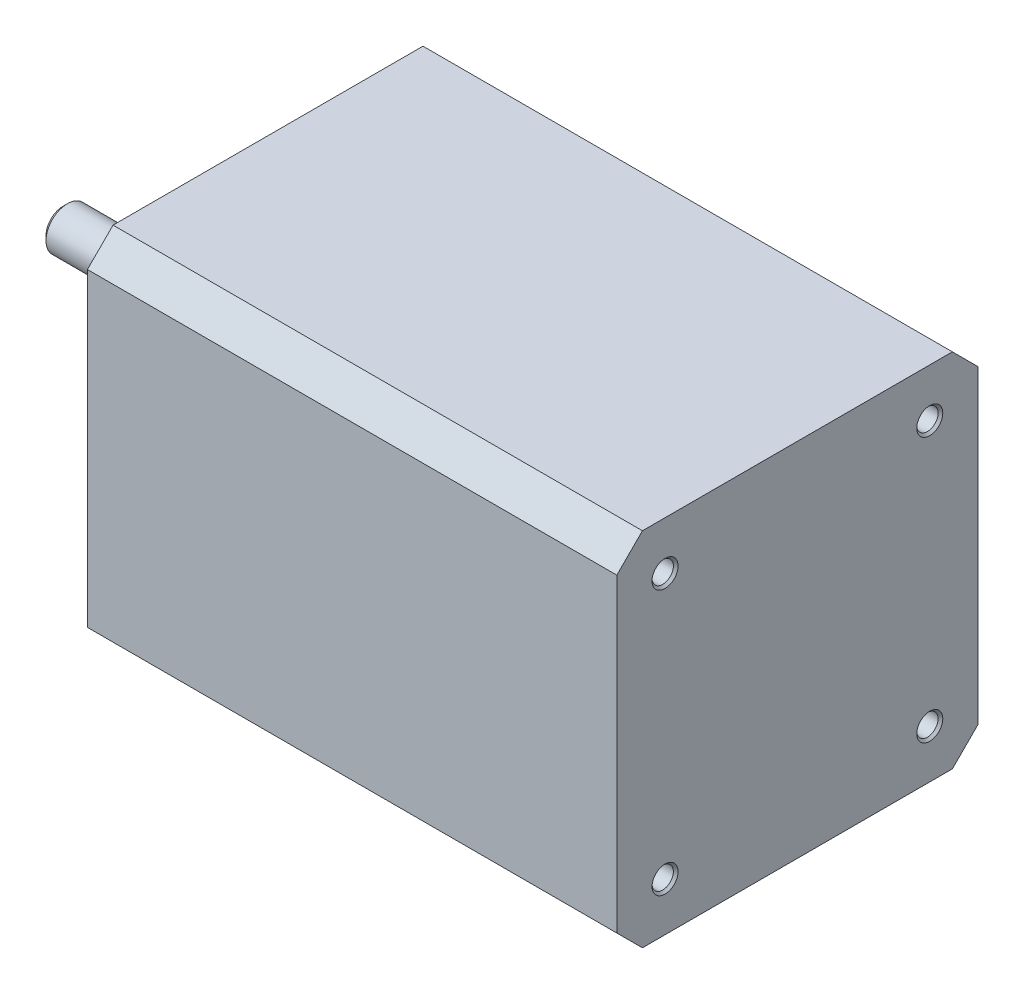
ISO-10303-21;
HEADER;
FILE_DESCRIPTION(('STEP AP214'),'2;1');
FILE_NAME('part.step','',(''),(''),'','','');
FILE_SCHEMA(('AUTOMOTIVE_DESIGN { 1 0 10303 214 1 1 1 1 }'));
ENDSEC;
DATA;
#1=APPLICATION_CONTEXT('core data for automotive mechanical design processes');
#2=APPLICATION_PROTOCOL_DEFINITION('international standard','automotive_design',2000,#1);
#3=PRODUCT_CONTEXT('',#1,'mechanical');
#4=PRODUCT('Part','Part','',(#3));
#5=PRODUCT_RELATED_PRODUCT_CATEGORY('part','',(#4));
#6=PRODUCT_DEFINITION_FORMATION('','',#4);
#7=PRODUCT_DEFINITION_CONTEXT('part definition',#1,'design');
#8=PRODUCT_DEFINITION('design','',#6,#7);
#9=PRODUCT_DEFINITION_SHAPE('','',#8);
#10=(LENGTH_UNIT() NAMED_UNIT(*) SI_UNIT(.MILLI.,.METRE.));
#11=(NAMED_UNIT(*) PLANE_ANGLE_UNIT() SI_UNIT($,.RADIAN.));
#12=(NAMED_UNIT(*) SI_UNIT($,.STERADIAN.) SOLID_ANGLE_UNIT());
#13=UNCERTAINTY_MEASURE_WITH_UNIT(LENGTH_MEASURE(1.E-05),#10,'distance_accuracy_value','');
#14=(GEOMETRIC_REPRESENTATION_CONTEXT(3) GLOBAL_UNCERTAINTY_ASSIGNED_CONTEXT((#13)) GLOBAL_UNIT_ASSIGNED_CONTEXT((#10,
#11,#12)) REPRESENTATION_CONTEXT('',''));
#15=CARTESIAN_POINT('',(0.,0.,0.));
#16=DIRECTION('',(0.,0.,1.));
#17=DIRECTION('',(1.,0.,0.));
#18=AXIS2_PLACEMENT_3D('',#15,#16,#17);
#19=CARTESIAN_POINT('',(62.,21.15,18.15));
#20=DIRECTION('',(0.,-1.,0.));
#21=DIRECTION('',(0.,0.,-1.));
#22=AXIS2_PLACEMENT_3D('',#19,#20,#21);
#23=PLANE('',#22);
#24=DIRECTION('',(0.,0.,1.));
#25=VECTOR('',#24,1.);
#26=CARTESIAN_POINT('',(0.,21.15,18.15));
#27=LINE('',#26,#25);
#28=CARTESIAN_POINT('',(0.,21.15,-18.15));
#29=VERTEX_POINT('',#28);
#30=CARTESIAN_POINT('',(0.,21.15,18.15));
#31=VERTEX_POINT('',#30);
#32=EDGE_CURVE('E150',#29,#31,#27,.T.);
#33=ORIENTED_EDGE('',*,*,#32,.T.);
#34=DIRECTION('',(-1.,0.,0.));
#35=VECTOR('',#34,1.);
#36=CARTESIAN_POINT('',(62.,21.15,18.15));
#37=LINE('',#36,#35);
#38=CARTESIAN_POINT('',(62.,21.15,18.15));
#39=VERTEX_POINT('',#38);
#40=EDGE_CURVE('E178',#39,#31,#37,.T.);
#41=ORIENTED_EDGE('',*,*,#40,.F.);
#42=DIRECTION('',(0.,0.,1.));
#43=VECTOR('',#42,1.);
#44=CARTESIAN_POINT('',(62.,21.15,18.15));
#45=LINE('',#44,#43);
#46=CARTESIAN_POINT('',(62.,21.15,-18.15));
#47=VERTEX_POINT('',#46);
#48=EDGE_CURVE('E165',#47,#39,#45,.T.);
#49=ORIENTED_EDGE('',*,*,#48,.F.);
#50=DIRECTION('',(-1.,0.,0.));
#51=VECTOR('',#50,1.);
#52=CARTESIAN_POINT('',(62.,21.15,-18.15));
#53=LINE('',#52,#51);
#54=EDGE_CURVE('E146',#47,#29,#53,.T.);
#55=ORIENTED_EDGE('',*,*,#54,.T.);
#56=EDGE_LOOP('',(#33,#41,#49,#55));
#57=FACE_BOUND('',#56,.T.);
#58=ADVANCED_FACE('F49',(#57),#23,.F.);
#59=CARTESIAN_POINT('',(62.,18.15,21.15));
#60=DIRECTION('',(0.,-0.707106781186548,-0.707106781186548));
#61=DIRECTION('',(0.,0.707106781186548,-0.707106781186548));
#62=AXIS2_PLACEMENT_3D('',#59,#60,#61);
#63=PLANE('',#62);
#64=DIRECTION('',(0.,-0.707106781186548,0.707106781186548));
#65=VECTOR('',#64,1.);
#66=CARTESIAN_POINT('',(0.,18.15,21.15));
#67=LINE('',#66,#65);
#68=CARTESIAN_POINT('',(0.,18.15,21.15));
#69=VERTEX_POINT('',#68);
#70=EDGE_CURVE('E153',#31,#69,#67,.T.);
#71=ORIENTED_EDGE('',*,*,#70,.T.);
#72=DIRECTION('',(-1.,0.,0.));
#73=VECTOR('',#72,1.);
#74=CARTESIAN_POINT('',(62.,18.15,21.15));
#75=LINE('',#74,#73);
#76=CARTESIAN_POINT('',(62.,18.15,21.15));
#77=VERTEX_POINT('',#76);
#78=EDGE_CURVE('E175',#77,#69,#75,.T.);
#79=ORIENTED_EDGE('',*,*,#78,.F.);
#80=DIRECTION('',(0.,-0.707106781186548,0.707106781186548));
#81=VECTOR('',#80,1.);
#82=CARTESIAN_POINT('',(62.,18.15,21.15));
#83=LINE('',#82,#81);
#84=EDGE_CURVE('E113',#39,#77,#83,.T.);
#85=ORIENTED_EDGE('',*,*,#84,.F.);
#86=ORIENTED_EDGE('',*,*,#40,.T.);
#87=EDGE_LOOP('',(#71,#79,#85,#86));
#88=FACE_BOUND('',#87,.T.);
#89=ADVANCED_FACE('F256',(#88),#63,.F.);
#90=CARTESIAN_POINT('',(62.,18.15,21.15));
#91=DIRECTION('',(0.,0.,-1.));
#92=DIRECTION('',(0.,1.,0.));
#93=AXIS2_PLACEMENT_3D('',#90,#91,#92);
#94=PLANE('',#93);
#95=DIRECTION('',(0.,-1.,0.));
#96=VECTOR('',#95,1.);
#97=CARTESIAN_POINT('',(0.,18.15,21.15));
#98=LINE('',#97,#96);
#99=CARTESIAN_POINT('',(0.,-18.15,21.15));
#100=VERTEX_POINT('',#99);
#101=EDGE_CURVE('E156',#69,#100,#98,.T.);
#102=ORIENTED_EDGE('',*,*,#101,.T.);
#103=DIRECTION('',(-1.,0.,0.));
#104=VECTOR('',#103,1.);
#105=CARTESIAN_POINT('',(62.,-18.15,21.15));
#106=LINE('',#105,#104);
#107=CARTESIAN_POINT('',(62.,-18.15,21.15));
#108=VERTEX_POINT('',#107);
#109=EDGE_CURVE('E172',#108,#100,#106,.T.);
#110=ORIENTED_EDGE('',*,*,#109,.F.);
#111=DIRECTION('',(0.,-1.,0.));
#112=VECTOR('',#111,1.);
#113=CARTESIAN_POINT('',(62.,18.15,21.15));
#114=LINE('',#113,#112);
#115=EDGE_CURVE('E223',#77,#108,#114,.T.);
#116=ORIENTED_EDGE('',*,*,#115,.F.);
#117=ORIENTED_EDGE('',*,*,#78,.T.);
#118=EDGE_LOOP('',(#102,#110,#116,#117));
#119=FACE_BOUND('',#118,.T.);
#120=ADVANCED_FACE('F260',(#119),#94,.F.);
#121=CARTESIAN_POINT('',(62.,-18.15,21.15));
#122=DIRECTION('',(0.,0.707106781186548,-0.707106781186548));
#123=DIRECTION('',(0.,0.707106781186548,0.707106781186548));
#124=AXIS2_PLACEMENT_3D('',#121,#122,#123);
#125=PLANE('',#124);
#126=DIRECTION('',(0.,-0.707106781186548,-0.707106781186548));
#127=VECTOR('',#126,1.);
#128=CARTESIAN_POINT('',(0.,-18.15,21.15));
#129=LINE('',#128,#127);
#130=CARTESIAN_POINT('',(0.,-21.15,18.15));
#131=VERTEX_POINT('',#130);
#132=EDGE_CURVE('E158',#100,#131,#129,.T.);
#133=ORIENTED_EDGE('',*,*,#132,.T.);
#134=DIRECTION('',(-1.,0.,0.));
#135=VECTOR('',#134,1.);
#136=CARTESIAN_POINT('',(62.,-21.15,18.15));
#137=LINE('',#136,#135);
#138=CARTESIAN_POINT('',(62.,-21.15,18.15));
#139=VERTEX_POINT('',#138);
#140=EDGE_CURVE('E169',#139,#131,#137,.T.);
#141=ORIENTED_EDGE('',*,*,#140,.F.);
#142=DIRECTION('',(0.,-0.707106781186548,-0.707106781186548));
#143=VECTOR('',#142,1.);
#144=CARTESIAN_POINT('',(62.,-18.15,21.15));
#145=LINE('',#144,#143);
#146=EDGE_CURVE('E225',#108,#139,#145,.T.);
#147=ORIENTED_EDGE('',*,*,#146,.F.);
#148=ORIENTED_EDGE('',*,*,#109,.T.);
#149=EDGE_LOOP('',(#133,#141,#147,#148));
#150=FACE_BOUND('',#149,.T.);
#151=ADVANCED_FACE('F231',(#150),#125,.F.);
#152=CARTESIAN_POINT('',(62.,-21.15,18.15));
#153=DIRECTION('',(0.,1.,0.));
#154=DIRECTION('',(0.,0.,1.));
#155=AXIS2_PLACEMENT_3D('',#152,#153,#154);
#156=PLANE('',#155);
#157=DIRECTION('',(0.,0.,-1.));
#158=VECTOR('',#157,1.);
#159=CARTESIAN_POINT('',(0.,-21.15,18.15));
#160=LINE('',#159,#158);
#161=CARTESIAN_POINT('',(0.,-21.15,-18.15));
#162=VERTEX_POINT('',#161);
#163=EDGE_CURVE('E160',#131,#162,#160,.T.);
#164=ORIENTED_EDGE('',*,*,#163,.T.);
#165=DIRECTION('',(-1.,0.,0.));
#166=VECTOR('',#165,1.);
#167=CARTESIAN_POINT('',(62.,-21.15,-18.15));
#168=LINE('',#167,#166);
#169=CARTESIAN_POINT('',(62.,-21.15,-18.15));
#170=VERTEX_POINT('',#169);
#171=EDGE_CURVE('E141',#170,#162,#168,.T.);
#172=ORIENTED_EDGE('',*,*,#171,.F.);
#173=DIRECTION('',(0.,0.,-1.));
#174=VECTOR('',#173,1.);
#175=CARTESIAN_POINT('',(62.,-21.15,18.15));
#176=LINE('',#175,#174);
#177=EDGE_CURVE('E132',#139,#170,#176,.T.);
#178=ORIENTED_EDGE('',*,*,#177,.F.);
#179=ORIENTED_EDGE('',*,*,#140,.T.);
#180=EDGE_LOOP('',(#164,#172,#178,#179));
#181=FACE_BOUND('',#180,.T.);
#182=ADVANCED_FACE('F235',(#181),#156,.F.);
#183=CARTESIAN_POINT('',(62.,-21.15,-18.15));
#184=DIRECTION('',(0.,0.707106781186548,0.707106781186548));
#185=DIRECTION('',(0.,-0.707106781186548,0.707106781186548));
#186=AXIS2_PLACEMENT_3D('',#183,#184,#185);
#187=PLANE('',#186);
#188=DIRECTION('',(0.,0.707106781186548,-0.707106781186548));
#189=VECTOR('',#188,1.);
#190=CARTESIAN_POINT('',(0.,-21.15,-18.15));
#191=LINE('',#190,#189);
#192=CARTESIAN_POINT('',(0.,-18.15,-21.15));
#193=VERTEX_POINT('',#192);
#194=EDGE_CURVE('E140',#162,#193,#191,.T.);
#195=ORIENTED_EDGE('',*,*,#194,.T.);
#196=DIRECTION('',(-1.,0.,0.));
#197=VECTOR('',#196,1.);
#198=CARTESIAN_POINT('',(62.,-18.15,-21.15));
#199=LINE('',#198,#197);
#200=CARTESIAN_POINT('',(62.,-18.15,-21.15));
#201=VERTEX_POINT('',#200);
#202=EDGE_CURVE('E137',#201,#193,#199,.T.);
#203=ORIENTED_EDGE('',*,*,#202,.F.);
#204=DIRECTION('',(0.,0.707106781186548,-0.707106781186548));
#205=VECTOR('',#204,1.);
#206=CARTESIAN_POINT('',(62.,-21.15,-18.15));
#207=LINE('',#206,#205);
#208=EDGE_CURVE('E126',#170,#201,#207,.T.);
#209=ORIENTED_EDGE('',*,*,#208,.F.);
#210=ORIENTED_EDGE('',*,*,#171,.T.);
#211=EDGE_LOOP('',(#195,#203,#209,#210));
#212=FACE_BOUND('',#211,.T.);
#213=ADVANCED_FACE('F138',(#212),#187,.F.);
#214=CARTESIAN_POINT('',(62.,18.15,-21.15));
#215=DIRECTION('',(0.,0.,1.));
#216=DIRECTION('',(0.,-1.,0.));
#217=AXIS2_PLACEMENT_3D('',#214,#215,#216);
#218=PLANE('',#217);
#219=DIRECTION('',(0.,1.,0.));
#220=VECTOR('',#219,1.);
#221=CARTESIAN_POINT('',(0.,18.15,-21.15));
#222=LINE('',#221,#220);
#223=CARTESIAN_POINT('',(0.,18.15,-21.15));
#224=VERTEX_POINT('',#223);
#225=EDGE_CURVE('E98',#193,#224,#222,.T.);
#226=ORIENTED_EDGE('',*,*,#225,.T.);
#227=DIRECTION('',(-1.,0.,0.));
#228=VECTOR('',#227,1.);
#229=CARTESIAN_POINT('',(62.,18.15,-21.15));
#230=LINE('',#229,#228);
#231=CARTESIAN_POINT('',(62.,18.15,-21.15));
#232=VERTEX_POINT('',#231);
#233=EDGE_CURVE('E142',#232,#224,#230,.T.);
#234=ORIENTED_EDGE('',*,*,#233,.F.);
#235=DIRECTION('',(0.,1.,0.));
#236=VECTOR('',#235,1.);
#237=CARTESIAN_POINT('',(62.,18.15,-21.15));
#238=LINE('',#237,#236);
#239=EDGE_CURVE('E130',#201,#232,#238,.T.);
#240=ORIENTED_EDGE('',*,*,#239,.F.);
#241=ORIENTED_EDGE('',*,*,#202,.T.);
#242=EDGE_LOOP('',(#226,#234,#240,#241));
#243=FACE_BOUND('',#242,.T.);
#244=ADVANCED_FACE('F144',(#243),#218,.F.);
#245=CARTESIAN_POINT('',(62.,21.15,-18.15));
#246=DIRECTION('',(0.,-0.707106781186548,0.707106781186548));
#247=DIRECTION('',(0.,-0.707106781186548,-0.707106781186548));
#248=AXIS2_PLACEMENT_3D('',#245,#246,#247);
#249=PLANE('',#248);
#250=DIRECTION('',(0.,0.707106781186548,0.707106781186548));
#251=VECTOR('',#250,1.);
#252=CARTESIAN_POINT('',(0.,21.15,-18.15));
#253=LINE('',#252,#251);
#254=EDGE_CURVE('E104',#224,#29,#253,.T.);
#255=ORIENTED_EDGE('',*,*,#254,.T.);
#256=ORIENTED_EDGE('',*,*,#54,.F.);
#257=DIRECTION('',(0.,0.707106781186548,0.707106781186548));
#258=VECTOR('',#257,1.);
#259=CARTESIAN_POINT('',(62.,21.15,-18.15));
#260=LINE('',#259,#258);
#261=EDGE_CURVE('E69',#232,#47,#260,.T.);
#262=ORIENTED_EDGE('',*,*,#261,.F.);
#263=ORIENTED_EDGE('',*,*,#233,.T.);
#264=EDGE_LOOP('',(#255,#256,#262,#263));
#265=FACE_BOUND('',#264,.T.);
#266=ADVANCED_FACE('F243',(#265),#249,.F.);
#267=CARTESIAN_POINT('',(62.,0.,0.));
#268=DIRECTION('',(-1.,0.,0.));
#269=DIRECTION('',(0.,0.,1.));
#270=AXIS2_PLACEMENT_3D('',#267,#268,#269);
#271=PLANE('',#270);
#272=CARTESIAN_POINT('',(62.,15.5,15.5));
#273=DIRECTION('',(1.,0.,0.));
#274=DIRECTION('',(0.,0.,-1.));
#275=AXIS2_PLACEMENT_3D('',#272,#273,#274);
#276=CIRCLE('',#275,1.525);
#277=CARTESIAN_POINT('',(62.,15.5,13.975));
#278=VERTEX_POINT('',#277);
#279=EDGE_CURVE('E442',#278,#278,#276,.T.);
#280=ORIENTED_EDGE('',*,*,#279,.F.);
#281=EDGE_LOOP('',(#280));
#282=FACE_BOUND('',#281,.T.);
#283=CARTESIAN_POINT('',(62.,-15.5,15.5));
#284=DIRECTION('',(1.,0.,0.));
#285=DIRECTION('',(0.,0.,-1.));
#286=AXIS2_PLACEMENT_3D('',#283,#284,#285);
#287=CIRCLE('',#286,1.525);
#288=CARTESIAN_POINT('',(62.,-15.5,13.975));
#289=VERTEX_POINT('',#288);
#290=EDGE_CURVE('E201',#289,#289,#287,.T.);
#291=ORIENTED_EDGE('',*,*,#290,.F.);
#292=EDGE_LOOP('',(#291));
#293=FACE_BOUND('',#292,.T.);
#294=CARTESIAN_POINT('',(62.,-15.5,-15.5));
#295=DIRECTION('',(1.,0.,0.));
#296=DIRECTION('',(0.,0.,-1.));
#297=AXIS2_PLACEMENT_3D('',#294,#295,#296);
#298=CIRCLE('',#297,1.525);
#299=CARTESIAN_POINT('',(62.,-15.5,-17.025));
#300=VERTEX_POINT('',#299);
#301=EDGE_CURVE('E194',#300,#300,#298,.T.);
#302=ORIENTED_EDGE('',*,*,#301,.F.);
#303=EDGE_LOOP('',(#302));
#304=FACE_BOUND('',#303,.T.);
#305=CARTESIAN_POINT('',(62.,15.5,-15.5));
#306=DIRECTION('',(1.,0.,0.));
#307=DIRECTION('',(0.,0.,-1.));
#308=AXIS2_PLACEMENT_3D('',#305,#306,#307);
#309=CIRCLE('',#308,1.525);
#310=CARTESIAN_POINT('',(62.,15.5,-17.025));
#311=VERTEX_POINT('',#310);
#312=EDGE_CURVE('E190',#311,#311,#309,.T.);
#313=ORIENTED_EDGE('',*,*,#312,.F.);
#314=EDGE_LOOP('',(#313));
#315=FACE_BOUND('',#314,.T.);
#316=ORIENTED_EDGE('',*,*,#48,.T.);
#317=ORIENTED_EDGE('',*,*,#84,.T.);
#318=ORIENTED_EDGE('',*,*,#115,.T.);
#319=ORIENTED_EDGE('',*,*,#146,.T.);
#320=ORIENTED_EDGE('',*,*,#177,.T.);
#321=ORIENTED_EDGE('',*,*,#208,.T.);
#322=ORIENTED_EDGE('',*,*,#239,.T.);
#323=ORIENTED_EDGE('',*,*,#261,.T.);
#324=EDGE_LOOP('',(#316,#317,#318,#319,#320,#321,#322,#323));
#325=FACE_BOUND('',#324,.T.);
#326=ADVANCED_FACE('F128',(#282,#293,#304,#315,#325),#271,.F.);
#327=CARTESIAN_POINT('',(0.,0.,0.));
#328=DIRECTION('',(-1.,0.,0.));
#329=DIRECTION('',(0.,0.,1.));
#330=AXIS2_PLACEMENT_3D('',#327,#328,#329);
#331=PLANE('',#330);
#332=CARTESIAN_POINT('',(0.,15.5,15.5));
#333=DIRECTION('',(-1.,0.,0.));
#334=DIRECTION('',(0.,0.,1.));
#335=AXIS2_PLACEMENT_3D('',#332,#333,#334);
#336=CIRCLE('',#335,1.24999999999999);
#337=CARTESIAN_POINT('',(0.,15.5,16.75));
#338=VERTEX_POINT('',#337);
#339=EDGE_CURVE('E54',#338,#338,#336,.T.);
#340=ORIENTED_EDGE('',*,*,#339,.F.);
#341=EDGE_LOOP('',(#340));
#342=FACE_BOUND('',#341,.T.);
#343=CARTESIAN_POINT('',(0.,-15.5,15.5));
#344=DIRECTION('',(-1.,0.,0.));
#345=DIRECTION('',(0.,0.,1.));
#346=AXIS2_PLACEMENT_3D('',#343,#344,#345);
#347=CIRCLE('',#346,1.24999999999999);
#348=CARTESIAN_POINT('',(0.,-15.5,16.75));
#349=VERTEX_POINT('',#348);
#350=EDGE_CURVE('E192',#349,#349,#347,.T.);
#351=ORIENTED_EDGE('',*,*,#350,.F.);
#352=EDGE_LOOP('',(#351));
#353=FACE_BOUND('',#352,.T.);
#354=CARTESIAN_POINT('',(0.,-15.5,-15.5));
#355=DIRECTION('',(-1.,0.,0.));
#356=DIRECTION('',(0.,0.,1.));
#357=AXIS2_PLACEMENT_3D('',#354,#355,#356);
#358=CIRCLE('',#357,1.24999999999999);
#359=CARTESIAN_POINT('',(0.,-15.5,-14.25));
#360=VERTEX_POINT('',#359);
#361=EDGE_CURVE('E188',#360,#360,#358,.T.);
#362=ORIENTED_EDGE('',*,*,#361,.F.);
#363=EDGE_LOOP('',(#362));
#364=FACE_BOUND('',#363,.T.);
#365=CARTESIAN_POINT('',(0.,15.5,-15.5));
#366=DIRECTION('',(-1.,0.,0.));
#367=DIRECTION('',(0.,0.,1.));
#368=AXIS2_PLACEMENT_3D('',#365,#366,#367);
#369=CIRCLE('',#368,1.24999999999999);
#370=CARTESIAN_POINT('',(0.,15.5,-14.25));
#371=VERTEX_POINT('',#370);
#372=EDGE_CURVE('E184',#371,#371,#369,.T.);
#373=ORIENTED_EDGE('',*,*,#372,.F.);
#374=EDGE_LOOP('',(#373));
#375=FACE_BOUND('',#374,.T.);
#376=CARTESIAN_POINT('',(0.,0.,0.));
#377=DIRECTION('',(-1.,0.,0.));
#378=DIRECTION('',(0.,0.,1.));
#379=AXIS2_PLACEMENT_3D('',#376,#377,#378);
#380=CIRCLE('',#379,11.);
#381=CARTESIAN_POINT('',(0.,0.,11.));
#382=VERTEX_POINT('',#381);
#383=EDGE_CURVE('E180',#382,#382,#380,.T.);
#384=ORIENTED_EDGE('',*,*,#383,.F.);
#385=EDGE_LOOP('',(#384));
#386=FACE_BOUND('',#385,.T.);
#387=ORIENTED_EDGE('',*,*,#32,.F.);
#388=ORIENTED_EDGE('',*,*,#254,.F.);
#389=ORIENTED_EDGE('',*,*,#225,.F.);
#390=ORIENTED_EDGE('',*,*,#194,.F.);
#391=ORIENTED_EDGE('',*,*,#163,.F.);
#392=ORIENTED_EDGE('',*,*,#132,.F.);
#393=ORIENTED_EDGE('',*,*,#101,.F.);
#394=ORIENTED_EDGE('',*,*,#70,.F.);
#395=EDGE_LOOP('',(#387,#388,#389,#390,#391,#392,#393,#394));
#396=FACE_BOUND('',#395,.T.);
#397=ADVANCED_FACE('F238',(#342,#353,#364,#375,#386,#396),#331,.T.);
#398=CARTESIAN_POINT('',(-2.,0.,0.));
#399=DIRECTION('',(1.,0.,0.));
#400=DIRECTION('',(0.,0.,-1.));
#401=AXIS2_PLACEMENT_3D('',#398,#399,#400);
#402=CYLINDRICAL_SURFACE('',#401,11.);
#403=CARTESIAN_POINT('',(-2.,0.,0.));
#404=DIRECTION('',(-1.,0.,0.));
#405=DIRECTION('',(0.,0.,1.));
#406=AXIS2_PLACEMENT_3D('',#403,#404,#405);
#407=CIRCLE('',#406,11.);
#408=CARTESIAN_POINT('',(-2.,0.,11.));
#409=VERTEX_POINT('',#408);
#410=EDGE_CURVE('E154',#409,#409,#407,.T.);
#411=ORIENTED_EDGE('',*,*,#410,.F.);
#412=EDGE_LOOP('',(#411));
#413=FACE_BOUND('',#412,.T.);
#414=ORIENTED_EDGE('',*,*,#383,.T.);
#415=EDGE_LOOP('',(#414));
#416=FACE_BOUND('',#415,.T.);
#417=ADVANCED_FACE('F301',(#413,#416),#402,.T.);
#418=CARTESIAN_POINT('',(-2.,0.,0.));
#419=DIRECTION('',(-1.,0.,0.));
#420=DIRECTION('',(0.,0.,1.));
#421=AXIS2_PLACEMENT_3D('',#418,#419,#420);
#422=PLANE('',#421);
#423=CARTESIAN_POINT('',(-2.,0.,0.));
#424=DIRECTION('',(-1.,0.,0.));
#425=DIRECTION('',(0.,0.,1.));
#426=AXIS2_PLACEMENT_3D('',#423,#424,#425);
#427=CIRCLE('',#426,2.5);
#428=CARTESIAN_POINT('',(-2.,0.,2.5));
#429=VERTEX_POINT('',#428);
#430=EDGE_CURVE('E182',#429,#429,#427,.T.);
#431=ORIENTED_EDGE('',*,*,#430,.F.);
#432=EDGE_LOOP('',(#431));
#433=FACE_BOUND('',#432,.T.);
#434=ORIENTED_EDGE('',*,*,#410,.T.);
#435=EDGE_LOOP('',(#434));
#436=FACE_BOUND('',#435,.T.);
#437=ADVANCED_FACE('F310',(#433,#436),#422,.T.);
#438=CARTESIAN_POINT('',(-24.,0.,0.));
#439=DIRECTION('',(1.,0.,0.));
#440=DIRECTION('',(0.,0.,-1.));
#441=AXIS2_PLACEMENT_3D('',#438,#439,#440);
#442=CYLINDRICAL_SURFACE('',#441,2.5);
#443=CARTESIAN_POINT('',(-23.5,0.,0.));
#444=DIRECTION('',(-1.,0.,0.));
#445=DIRECTION('',(0.,0.,1.));
#446=AXIS2_PLACEMENT_3D('',#443,#444,#445);
#447=CIRCLE('',#446,2.5);
#448=CARTESIAN_POINT('',(-23.5,0.,2.5));
#449=VERTEX_POINT('',#448);
#450=EDGE_CURVE('E11',#449,#449,#447,.F.);
#451=ORIENTED_EDGE('',*,*,#450,.T.);
#452=EDGE_LOOP('',(#451));
#453=FACE_BOUND('',#452,.T.);
#454=ORIENTED_EDGE('',*,*,#430,.T.);
#455=EDGE_LOOP('',(#454));
#456=FACE_BOUND('',#455,.T.);
#457=ADVANCED_FACE('F320',(#453,#456),#442,.T.);
#458=CARTESIAN_POINT('',(-24.,0.,0.));
#459=DIRECTION('',(-1.,0.,0.));
#460=DIRECTION('',(0.,0.,1.));
#461=AXIS2_PLACEMENT_3D('',#458,#459,#460);
#462=PLANE('',#461);
#463=CARTESIAN_POINT('',(-24.,0.,0.));
#464=DIRECTION('',(-1.,0.,0.));
#465=DIRECTION('',(0.,0.,1.));
#466=AXIS2_PLACEMENT_3D('',#463,#464,#465);
#467=CIRCLE('',#466,2.00000000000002);
#468=CARTESIAN_POINT('',(-24.,0.,2.00000000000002));
#469=VERTEX_POINT('',#468);
#470=EDGE_CURVE('E60',#469,#469,#467,.T.);
#471=ORIENTED_EDGE('',*,*,#470,.T.);
#472=EDGE_LOOP('',(#471));
#473=FACE_BOUND('',#472,.T.);
#474=ADVANCED_FACE('F330',(#473),#462,.T.);
#475=CARTESIAN_POINT('',(-24.,0.,0.));
#476=DIRECTION('',(1.,0.,0.));
#477=DIRECTION('',(0.,0.,-1.));
#478=AXIS2_PLACEMENT_3D('',#475,#476,#477);
#479=CONICAL_SURFACE('',#478,2.00000000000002,0.785398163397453);
#480=ORIENTED_EDGE('',*,*,#450,.F.);
#481=EDGE_LOOP('',(#480));
#482=FACE_BOUND('',#481,.T.);
#483=ORIENTED_EDGE('',*,*,#470,.F.);
#484=EDGE_LOOP('',(#483));
#485=FACE_BOUND('',#484,.T.);
#486=ADVANCED_FACE('F52',(#482,#485),#479,.T.);
#487=CARTESIAN_POINT('',(62.,15.5,-15.5));
#488=DIRECTION('',(1.,0.,0.));
#489=DIRECTION('',(0.,0.,-1.));
#490=AXIS2_PLACEMENT_3D('',#487,#488,#489);
#491=CYLINDRICAL_SURFACE('',#490,1.24999999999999);
#492=ORIENTED_EDGE('',*,*,#372,.T.);
#493=EDGE_LOOP('',(#492));
#494=FACE_BOUND('',#493,.T.);
#495=CARTESIAN_POINT('',(61.725,15.5,-15.5));
#496=DIRECTION('',(1.,0.,0.));
#497=DIRECTION('',(0.,0.,-1.));
#498=AXIS2_PLACEMENT_3D('',#495,#496,#497);
#499=CIRCLE('',#498,1.25);
#500=CARTESIAN_POINT('',(61.725,15.5,-16.75));
#501=VERTEX_POINT('',#500);
#502=EDGE_CURVE('E187',#501,#501,#499,.T.);
#503=ORIENTED_EDGE('',*,*,#502,.T.);
#504=EDGE_LOOP('',(#503));
#505=FACE_BOUND('',#504,.T.);
#506=ADVANCED_FACE('F348',(#494,#505),#491,.F.);
#507=CARTESIAN_POINT('',(62.,15.5,-15.5));
#508=DIRECTION('',(1.,0.,0.));
#509=DIRECTION('',(0.,0.,-1.));
#510=AXIS2_PLACEMENT_3D('',#507,#508,#509);
#511=CONICAL_SURFACE('',#510,1.525,0.785398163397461);
#512=ORIENTED_EDGE('',*,*,#502,.F.);
#513=EDGE_LOOP('',(#512));
#514=FACE_BOUND('',#513,.T.);
#515=ORIENTED_EDGE('',*,*,#312,.T.);
#516=EDGE_LOOP('',(#515));
#517=FACE_BOUND('',#516,.T.);
#518=ADVANCED_FACE('F357',(#514,#517),#511,.F.);
#519=CARTESIAN_POINT('',(62.,-15.5,-15.5));
#520=DIRECTION('',(1.,0.,0.));
#521=DIRECTION('',(0.,0.,-1.));
#522=AXIS2_PLACEMENT_3D('',#519,#520,#521);
#523=CYLINDRICAL_SURFACE('',#522,1.24999999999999);
#524=ORIENTED_EDGE('',*,*,#361,.T.);
#525=EDGE_LOOP('',(#524));
#526=FACE_BOUND('',#525,.T.);
#527=CARTESIAN_POINT('',(61.725,-15.5,-15.5));
#528=DIRECTION('',(1.,0.,0.));
#529=DIRECTION('',(0.,0.,-1.));
#530=AXIS2_PLACEMENT_3D('',#527,#528,#529);
#531=CIRCLE('',#530,1.25);
#532=CARTESIAN_POINT('',(61.725,-15.5,-16.75));
#533=VERTEX_POINT('',#532);
#534=EDGE_CURVE('E191',#533,#533,#531,.T.);
#535=ORIENTED_EDGE('',*,*,#534,.T.);
#536=EDGE_LOOP('',(#535));
#537=FACE_BOUND('',#536,.T.);
#538=ADVANCED_FACE('F368',(#526,#537),#523,.F.);
#539=CARTESIAN_POINT('',(62.,-15.5,-15.5));
#540=DIRECTION('',(1.,0.,0.));
#541=DIRECTION('',(0.,0.,-1.));
#542=AXIS2_PLACEMENT_3D('',#539,#540,#541);
#543=CONICAL_SURFACE('',#542,1.525,0.785398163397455);
#544=ORIENTED_EDGE('',*,*,#534,.F.);
#545=EDGE_LOOP('',(#544));
#546=FACE_BOUND('',#545,.T.);
#547=ORIENTED_EDGE('',*,*,#301,.T.);
#548=EDGE_LOOP('',(#547));
#549=FACE_BOUND('',#548,.T.);
#550=ADVANCED_FACE('F379',(#546,#549),#543,.F.);
#551=CARTESIAN_POINT('',(62.,-15.5,15.5));
#552=DIRECTION('',(1.,0.,0.));
#553=DIRECTION('',(0.,0.,-1.));
#554=AXIS2_PLACEMENT_3D('',#551,#552,#553);
#555=CYLINDRICAL_SURFACE('',#554,1.24999999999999);
#556=ORIENTED_EDGE('',*,*,#350,.T.);
#557=EDGE_LOOP('',(#556));
#558=FACE_BOUND('',#557,.T.);
#559=CARTESIAN_POINT('',(61.725,-15.5,15.5));
#560=DIRECTION('',(1.,0.,0.));
#561=DIRECTION('',(0.,0.,-1.));
#562=AXIS2_PLACEMENT_3D('',#559,#560,#561);
#563=CIRCLE('',#562,1.25);
#564=CARTESIAN_POINT('',(61.725,-15.5,14.25));
#565=VERTEX_POINT('',#564);
#566=EDGE_CURVE('E195',#565,#565,#563,.T.);
#567=ORIENTED_EDGE('',*,*,#566,.T.);
#568=EDGE_LOOP('',(#567));
#569=FACE_BOUND('',#568,.T.);
#570=ADVANCED_FACE('F390',(#558,#569),#555,.F.);
#571=CARTESIAN_POINT('',(62.,-15.5,15.5));
#572=DIRECTION('',(1.,0.,0.));
#573=DIRECTION('',(0.,0.,-1.));
#574=AXIS2_PLACEMENT_3D('',#571,#572,#573);
#575=CONICAL_SURFACE('',#574,1.525,0.785398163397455);
#576=ORIENTED_EDGE('',*,*,#566,.F.);
#577=EDGE_LOOP('',(#576));
#578=FACE_BOUND('',#577,.T.);
#579=ORIENTED_EDGE('',*,*,#290,.T.);
#580=EDGE_LOOP('',(#579));
#581=FACE_BOUND('',#580,.T.);
#582=ADVANCED_FACE('F401',(#578,#581),#575,.F.);
#583=CARTESIAN_POINT('',(62.,15.5,15.5));
#584=DIRECTION('',(1.,0.,0.));
#585=DIRECTION('',(0.,0.,-1.));
#586=AXIS2_PLACEMENT_3D('',#583,#584,#585);
#587=CYLINDRICAL_SURFACE('',#586,1.24999999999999);
#588=ORIENTED_EDGE('',*,*,#339,.T.);
#589=EDGE_LOOP('',(#588));
#590=FACE_BOUND('',#589,.T.);
#591=CARTESIAN_POINT('',(61.725,15.5,15.5));
#592=DIRECTION('',(1.,0.,0.));
#593=DIRECTION('',(0.,0.,-1.));
#594=AXIS2_PLACEMENT_3D('',#591,#592,#593);
#595=CIRCLE('',#594,1.25);
#596=CARTESIAN_POINT('',(61.725,15.5,14.25));
#597=VERTEX_POINT('',#596);
#598=EDGE_CURVE('E439',#597,#597,#595,.T.);
#599=ORIENTED_EDGE('',*,*,#598,.T.);
#600=EDGE_LOOP('',(#599));
#601=FACE_BOUND('',#600,.T.);
#602=ADVANCED_FACE('F411',(#590,#601),#587,.F.);
#603=CARTESIAN_POINT('',(62.,15.5,15.5));
#604=DIRECTION('',(1.,0.,0.));
#605=DIRECTION('',(0.,0.,-1.));
#606=AXIS2_PLACEMENT_3D('',#603,#604,#605);
#607=CONICAL_SURFACE('',#606,1.525,0.785398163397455);
#608=ORIENTED_EDGE('',*,*,#598,.F.);
#609=EDGE_LOOP('',(#608));
#610=FACE_BOUND('',#609,.T.);
#611=ORIENTED_EDGE('',*,*,#279,.T.);
#612=EDGE_LOOP('',(#611));
#613=FACE_BOUND('',#612,.T.);
#614=ADVANCED_FACE('F422',(#610,#613),#607,.F.);
#615=CLOSED_SHELL('',(#58,#89,#120,#151,#182,#213,#244,#266,#326,#397,#417,#437,#457,#474,#486,
#506,#518,#538,#550,#570,#582,#602,#614));
#616=MANIFOLD_SOLID_BREP('B2',#615);
#617=ADVANCED_BREP_SHAPE_REPRESENTATION('',(#18,#616),#14);
#618=SHAPE_DEFINITION_REPRESENTATION(#9,#617);
ENDSEC;
END-ISO-10303-21;
